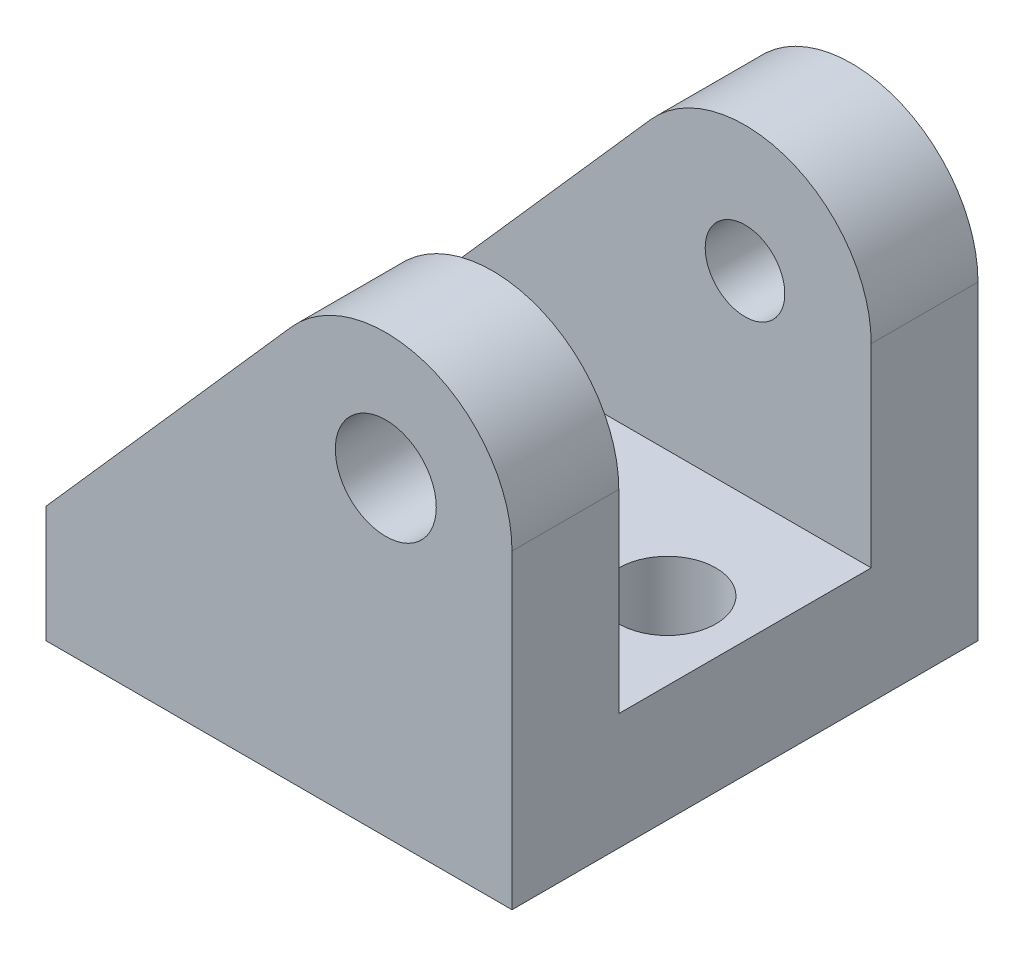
from build123d import *

# Parameters (mm, degrees)
EXTRUDE_1_DEPTH          = 6
SKETCH_2_W               = 26.116565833
SKETCH_2_H               = 6.5
CUT_EXTRUDE_1_DEPTH      = 20
SKETCH_3_R               = 1.3
CUT_EXTRUDE_2_DEPTH      = 5
HOLE_WIZARD_M2_5_1_D     = 2.05
HOLE_WIZARD_M2_5_1_DEPTH = 7.25
HOLE_WIZARD_M2_5_1_TIP   = 0.615882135
HOLE_WIZARD_M3_1_D       = 2.5
HOLE_WIZARD_M3_1_DEPTH   = 8.5
HOLE_WIZARD_M3_1_TIP     = 0.751075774


with BuildPart() as part:
    # Sketch 1 → Extrude 1 (new, symmetric)
    with BuildSketch(Plane.XY):
        with BuildLine():
            Line((-2.436302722, 10.151029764), (-8.75, 3))
            Line((-8.75, 3), (-8.75, 0))
            Line((-8.75, 0), (3.25, 0))
            Line((3.25, 0), (3.25, 8))
            ThreePointArc((3.25, 8), (1.149894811, 11.039776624), (-2.436302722, 10.151029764))
        make_face()
    extrude(amount=EXTRUDE_1_DEPTH, both=True)

    # Sketch 2 → Cut-Extrude 1 (cut)
    with BuildSketch(Plane(origin=(0, 3, 0), x_dir=(-1, 0, 0), z_dir=(0, -1, 0))):
        with Locations((3.226050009, 0)):
            Rectangle(SKETCH_2_W, SKETCH_2_H)
    extrude(amount=-CUT_EXTRUDE_1_DEPTH, mode=Mode.SUBTRACT)

    # Sketch 3 → Cut-Extrude 2 (cut)
    with BuildSketch(Plane.XY.offset(6)):
        with Locations((0, 8)):
            Circle(SKETCH_3_R)
    extrude(amount=-CUT_EXTRUDE_2_DEPTH, mode=Mode.SUBTRACT)

    # Hole Wizard M2.5 _1
    with Locations(Plane(origin=(0, 8, -6), x_dir=(-1, 0, 0), z_dir=(0, 0, -1))):
        with Locations((0, 0)):
            Hole(HOLE_WIZARD_M2_5_1_D / 2, depth=HOLE_WIZARD_M2_5_1_DEPTH)
            with Locations((0, 0, -(HOLE_WIZARD_M2_5_1_DEPTH + HOLE_WIZARD_M2_5_1_TIP / 2))):  # 118° drill point
                Cone(0, HOLE_WIZARD_M2_5_1_D / 2, HOLE_WIZARD_M2_5_1_TIP, mode=Mode.SUBTRACT)

    # Hole Wizard M3 _1
    with Locations(Plane(origin=(-6.75, 0, 0), x_dir=(0, 0, -1), z_dir=(0, -1, 0))):
        with Locations((0, 0), (0, 8)):
            Hole(HOLE_WIZARD_M3_1_D / 2, depth=HOLE_WIZARD_M3_1_DEPTH)
            with Locations((0, 0, -(HOLE_WIZARD_M3_1_DEPTH + HOLE_WIZARD_M3_1_TIP / 2))):  # 118° drill point
                Cone(0, HOLE_WIZARD_M3_1_D / 2, HOLE_WIZARD_M3_1_TIP, mode=Mode.SUBTRACT)


solid = part.part
